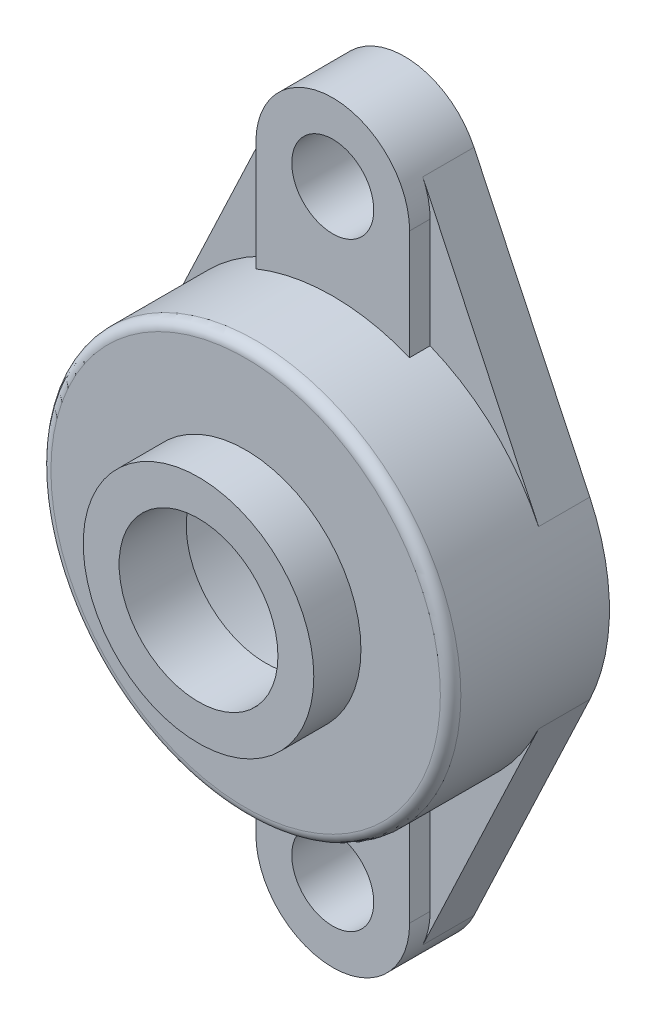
from build123d import *
from build123d.topology import SkipClean

# Parameters (mm, degrees)
BASE_EXTRUSION_DEPTH    = 10
ESQUISSE2_R             = 40
BOSS_EXTRU_1_DEPTH      = 21
ESQUISSE3_R             = 22.5
BOSS_EXTRU_2_DEPTH      = 9.2
BOSS_EXTRU_3_DEPTH      = 4
ESQUISSE4_R             = 15.5
ENL_V_MAT_EXTRU_1_DEPTH = 93.834745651
ESQUISSE6_R             = 36
ENL_V_MAT_EXTRU_2_DEPTH = 2.1
ESQUISSE8_R             = 8
ENL_V_MAT_EXTRU_3_DEPTH = 93.834745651
CONG_1_R                = 2
ESQUISSE9_R             = 31
ENL_V_MAT_EXTRU_4_DEPTH = 24
ESQUISSE10_R            = 25
ENL_V_MAT_EXTRU_5_DEPTH = 1


with BuildPart() as part:
    # Esquisse1 → Base-Extrusion (new body)
    with BuildSketch(Plane.XY):
        with BuildLine():
            Line((-36.163442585, 17.094017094), (-13.561290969, 64.91025641))
            ThreePointArc((-13.561290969, 64.91025641), (0, 73.5), (13.561290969, 64.91025641))
            Line((13.561290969, 64.91025641), (36.163442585, 17.094017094))
            ThreePointArc((36.163442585, 17.094017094), (40, 0), (36.163442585, -17.094017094))
            Line((36.163442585, -17.094017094), (13.561290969, -64.91025641))
            ThreePointArc((13.561290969, -64.91025641), (0, -73.5), (-13.561290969, -64.91025641))
            Line((-13.561290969, -64.91025641), (-36.163442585, -17.094017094))
            ThreePointArc((-36.163442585, -17.094017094), (-40, 0), (-36.163442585, 17.094017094))
        make_face()
    extrude(amount=BASE_EXTRUSION_DEPTH)

    # Esquisse2 → Boss.-Extru.1 (add)
    with BuildSketch(Plane.XY.offset(10)):
        with Locations(Location((0, 0, 0), (0, 0, 154.700471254))):
            Circle(ESQUISSE2_R)
    extrude(amount=BOSS_EXTRU_1_DEPTH)

    # Esquisse3 → Boss.-Extru.2 (add)
    with BuildSketch(Plane.XY.offset(31)):
        Circle(ESQUISSE3_R)
    extrude(amount=BOSS_EXTRU_2_DEPTH)

    # Esquisse5 → Boss.-Extru.3 (add)
    with BuildSketch(Plane.XY.offset(10)):
        with BuildLine():
            Line((15, 58.5), (15, -58.5))
            ThreePointArc((15, -58.5), (0, -73.5), (-15, -58.5))
            Line((-15, -58.5), (-15, 58.5))
            ThreePointArc((-15, 58.5), (0, 73.5), (15, 58.5))
        make_face()
    extrude(amount=BOSS_EXTRU_3_DEPTH)

    # Esquisse4 → Enl_v. mat.-Extru.1 (cut, through all)
    with BuildSketch(Plane.XY.offset(40.2)):
        Circle(ESQUISSE4_R)
    extrude(amount=-ENL_V_MAT_EXTRU_1_DEPTH, mode=Mode.SUBTRACT)

    # Esquisse6 → Enl_v. mat.-Extru.2 (cut)
    with BuildSketch(Plane(origin=(0, 0, 0), x_dir=(-1, 0, 0), z_dir=(0, 0, -1))):
        Circle(ESQUISSE6_R)
    extrude(amount=-ENL_V_MAT_EXTRU_2_DEPTH, mode=Mode.SUBTRACT)

    # Esquisse8 → Enl_v. mat.-Extru.3 (cut, through all)
    with BuildSketch(Plane(origin=(0, 0, 0), x_dir=(-1, 0, 0), z_dir=(0, 0, -1))):
        with Locations((0, 58.5)):
            Circle(ESQUISSE8_R)
        with Locations((0, -58.5)):
            Circle(ESQUISSE8_R)
    extrude(amount=-ENL_V_MAT_EXTRU_3_DEPTH, mode=Mode.SUBTRACT)

    # Cong_1
    cong_1_edges = [part.edges().sort_by_distance(p)[0] for p in [
        (36.163442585, -17.094017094, 31),
    ]]
    fillet(cong_1_edges, radius=CONG_1_R)

    # Esquisse9 → Enl_v. mat.-Extru.4 (cut)
    with SkipClean():  # the faces are left unmerged after this step: merging them gives an invalid solid
        with BuildSketch(Plane(origin=(0, 0, 2.1), x_dir=(-1, 0, 0), z_dir=(0, 0, -1))):
            with Locations(Location((0, 0, 0), (0, 0, 90))):
                Circle(ESQUISSE9_R)
        extrude(amount=-ENL_V_MAT_EXTRU_4_DEPTH, mode=Mode.SUBTRACT)

    # Esquisse10 → Enl_v. mat.-Extru.5 (cut)
    with SkipClean():  # the faces are left unmerged after this step: merging them gives an invalid solid
        with BuildSketch(Plane(origin=(0, 0, 26.1), x_dir=(-1, 0, 0), z_dir=(0, 0, -1))):
            with Locations(Location((0, 0, 0), (0, 0, 90))):
                Circle(ESQUISSE10_R)
        extrude(amount=-ENL_V_MAT_EXTRU_5_DEPTH, mode=Mode.SUBTRACT)


solid = part.part
